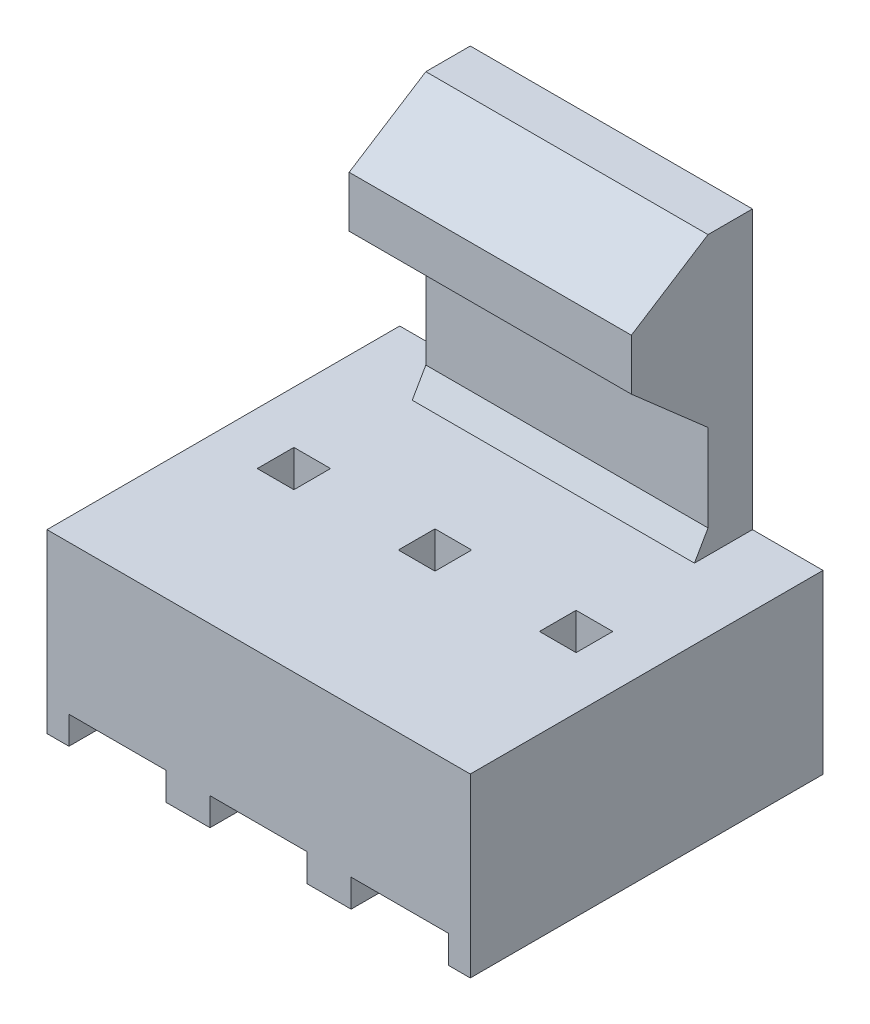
ISO-10303-21;
HEADER;
FILE_DESCRIPTION(('STEP AP214'),'2;1');
FILE_NAME('part.step','',(''),(''),'','','');
FILE_SCHEMA(('AUTOMOTIVE_DESIGN { 1 0 10303 214 1 1 1 1 }'));
ENDSEC;
DATA;
#1=APPLICATION_CONTEXT('core data for automotive mechanical design processes');
#2=APPLICATION_PROTOCOL_DEFINITION('international standard','automotive_design',2000,#1);
#3=PRODUCT_CONTEXT('',#1,'mechanical');
#4=PRODUCT('Part','Part','',(#3));
#5=PRODUCT_RELATED_PRODUCT_CATEGORY('part','',(#4));
#6=PRODUCT_DEFINITION_FORMATION('','',#4);
#7=PRODUCT_DEFINITION_CONTEXT('part definition',#1,'design');
#8=PRODUCT_DEFINITION('design','',#6,#7);
#9=PRODUCT_DEFINITION_SHAPE('','',#8);
#10=(LENGTH_UNIT() NAMED_UNIT(*) SI_UNIT(.MILLI.,.METRE.));
#11=(NAMED_UNIT(*) PLANE_ANGLE_UNIT() SI_UNIT($,.RADIAN.));
#12=(NAMED_UNIT(*) SI_UNIT($,.STERADIAN.) SOLID_ANGLE_UNIT());
#13=UNCERTAINTY_MEASURE_WITH_UNIT(LENGTH_MEASURE(1.E-05),#10,'distance_accuracy_value','');
#14=(GEOMETRIC_REPRESENTATION_CONTEXT(3) GLOBAL_UNCERTAINTY_ASSIGNED_CONTEXT((#13)) GLOBAL_UNIT_ASSIGNED_CONTEXT((#10,
#11,#12)) REPRESENTATION_CONTEXT('',''));
#15=CARTESIAN_POINT('',(0.,0.,0.));
#16=DIRECTION('',(0.,0.,1.));
#17=DIRECTION('',(1.,0.,0.));
#18=AXIS2_PLACEMENT_3D('',#15,#16,#17);
#19=CARTESIAN_POINT('',(-3.81,-3.18,-6.35));
#20=DIRECTION('',(0.,-1.,0.));
#21=DIRECTION('',(0.,0.,-1.));
#22=AXIS2_PLACEMENT_3D('',#19,#20,#21);
#23=PLANE('',#22);
#24=DIRECTION('',(0.,0.,1.));
#25=VECTOR('',#24,1.);
#26=CARTESIAN_POINT('',(1.665,-3.18,-6.351));
#27=LINE('',#26,#25);
#28=CARTESIAN_POINT('',(1.665,-3.18,-6.35));
#29=VERTEX_POINT('',#28);
#30=CARTESIAN_POINT('',(1.665,-3.18,0.));
#31=VERTEX_POINT('',#30);
#32=EDGE_CURVE('E443',#29,#31,#27,.T.);
#33=ORIENTED_EDGE('',*,*,#32,.T.);
#34=DIRECTION('',(1.,0.,0.));
#35=VECTOR('',#34,1.);
#36=CARTESIAN_POINT('',(-3.81,-3.18,0.));
#37=LINE('',#36,#35);
#38=CARTESIAN_POINT('',(0.875,-3.18,0.));
#39=VERTEX_POINT('',#38);
#40=EDGE_CURVE('E545',#39,#31,#37,.T.);
#41=ORIENTED_EDGE('',*,*,#40,.F.);
#42=DIRECTION('',(0.,0.,1.));
#43=VECTOR('',#42,1.);
#44=CARTESIAN_POINT('',(0.875,-3.18,-6.351));
#45=LINE('',#44,#43);
#46=CARTESIAN_POINT('',(0.875000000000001,-3.18,-6.35));
#47=VERTEX_POINT('',#46);
#48=EDGE_CURVE('E475',#47,#39,#45,.T.);
#49=ORIENTED_EDGE('',*,*,#48,.F.);
#50=DIRECTION('',(-1.,0.,0.));
#51=VECTOR('',#50,1.);
#52=CARTESIAN_POINT('',(-3.81,-3.18,-6.35));
#53=LINE('',#52,#51);
#54=EDGE_CURVE('E533',#29,#47,#53,.T.);
#55=ORIENTED_EDGE('',*,*,#54,.F.);
#56=EDGE_LOOP('',(#33,#41,#49,#55));
#57=FACE_BOUND('',#56,.T.);
#58=ADVANCED_FACE('F30',(#57),#23,.T.);
#59=DIRECTION('',(0.,0.,1.));
#60=VECTOR('',#59,1.);
#61=CARTESIAN_POINT('',(-0.874999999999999,-3.18,-6.351));
#62=LINE('',#61,#60);
#63=CARTESIAN_POINT('',(-0.874999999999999,-3.18,-6.35));
#64=VERTEX_POINT('',#63);
#65=CARTESIAN_POINT('',(-0.874999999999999,-3.18,0.));
#66=VERTEX_POINT('',#65);
#67=EDGE_CURVE('E469',#64,#66,#62,.T.);
#68=ORIENTED_EDGE('',*,*,#67,.T.);
#69=CARTESIAN_POINT('',(-1.665,-3.18,0.));
#70=VERTEX_POINT('',#69);
#71=EDGE_CURVE('E539',#70,#66,#37,.T.);
#72=ORIENTED_EDGE('',*,*,#71,.F.);
#73=DIRECTION('',(0.,0.,1.));
#74=VECTOR('',#73,1.);
#75=CARTESIAN_POINT('',(-1.665,-3.18,-6.351));
#76=LINE('',#75,#74);
#77=CARTESIAN_POINT('',(-1.665,-3.18,-6.35));
#78=VERTEX_POINT('',#77);
#79=EDGE_CURVE('E501',#78,#70,#76,.T.);
#80=ORIENTED_EDGE('',*,*,#79,.F.);
#81=EDGE_CURVE('E927',#64,#78,#53,.T.);
#82=ORIENTED_EDGE('',*,*,#81,.F.);
#83=EDGE_LOOP('',(#68,#72,#80,#82));
#84=FACE_BOUND('',#83,.T.);
#85=ADVANCED_FACE('F589',(#84),#23,.T.);
#86=DIRECTION('',(0.,0.,1.));
#87=VECTOR('',#86,1.);
#88=CARTESIAN_POINT('',(-3.415,-3.18,-6.351));
#89=LINE('',#88,#87);
#90=CARTESIAN_POINT('',(-3.415,-3.18,-6.35));
#91=VERTEX_POINT('',#90);
#92=CARTESIAN_POINT('',(-3.415,-3.18,0.));
#93=VERTEX_POINT('',#92);
#94=EDGE_CURVE('E495',#91,#93,#89,.T.);
#95=ORIENTED_EDGE('',*,*,#94,.T.);
#96=CARTESIAN_POINT('',(-3.81,-3.18,0.));
#97=VERTEX_POINT('',#96);
#98=EDGE_CURVE('E537',#97,#93,#37,.T.);
#99=ORIENTED_EDGE('',*,*,#98,.F.);
#100=DIRECTION('',(0.,0.,1.));
#101=VECTOR('',#100,1.);
#102=CARTESIAN_POINT('',(-3.81,-3.18,0.));
#103=LINE('',#102,#101);
#104=CARTESIAN_POINT('',(-3.81,-3.18,-6.35));
#105=VERTEX_POINT('',#104);
#106=EDGE_CURVE('E516',#105,#97,#103,.T.);
#107=ORIENTED_EDGE('',*,*,#106,.F.);
#108=EDGE_CURVE('E534',#91,#105,#53,.T.);
#109=ORIENTED_EDGE('',*,*,#108,.F.);
#110=EDGE_LOOP('',(#95,#99,#107,#109));
#111=FACE_BOUND('',#110,.T.);
#112=ADVANCED_FACE('F558',(#111),#23,.T.);
#113=CARTESIAN_POINT('',(-3.81,-3.18,0.));
#114=DIRECTION('',(-1.,0.,0.));
#115=DIRECTION('',(0.,0.,1.));
#116=AXIS2_PLACEMENT_3D('',#113,#114,#115);
#117=PLANE('',#116);
#118=DIRECTION('',(0.,0.,1.));
#119=VECTOR('',#118,1.);
#120=CARTESIAN_POINT('',(-3.81,0.,0.));
#121=LINE('',#120,#119);
#122=CARTESIAN_POINT('',(-3.81,0.,-6.35));
#123=VERTEX_POINT('',#122);
#124=CARTESIAN_POINT('',(-3.81,0.,0.));
#125=VERTEX_POINT('',#124);
#126=EDGE_CURVE('E498',#123,#125,#121,.T.);
#127=ORIENTED_EDGE('',*,*,#126,.F.);
#128=DIRECTION('',(0.,1.,0.));
#129=VECTOR('',#128,1.);
#130=CARTESIAN_POINT('',(-3.81,-3.18,-6.35));
#131=LINE('',#130,#129);
#132=EDGE_CURVE('E11',#105,#123,#131,.T.);
#133=ORIENTED_EDGE('',*,*,#132,.F.);
#134=ORIENTED_EDGE('',*,*,#106,.T.);
#135=DIRECTION('',(0.,1.,0.));
#136=VECTOR('',#135,1.);
#137=CARTESIAN_POINT('',(-3.81,-3.18,0.));
#138=LINE('',#137,#136);
#139=EDGE_CURVE('E525',#97,#125,#138,.T.);
#140=ORIENTED_EDGE('',*,*,#139,.T.);
#141=EDGE_LOOP('',(#127,#133,#134,#140));
#142=FACE_BOUND('',#141,.T.);
#143=ADVANCED_FACE('F32',(#142),#117,.T.);
#144=CARTESIAN_POINT('',(-3.81,-3.18,-6.35));
#145=DIRECTION('',(0.,0.,-1.));
#146=DIRECTION('',(-1.,0.,0.));
#147=AXIS2_PLACEMENT_3D('',#144,#145,#146);
#148=PLANE('',#147);
#149=DIRECTION('',(0.,-1.,0.));
#150=VECTOR('',#149,1.);
#151=CARTESIAN_POINT('',(1.665,-3.18,-6.35));
#152=LINE('',#151,#150);
#153=CARTESIAN_POINT('',(1.665,-2.68,-6.35));
#154=VERTEX_POINT('',#153);
#155=EDGE_CURVE('E432',#154,#29,#152,.T.);
#156=ORIENTED_EDGE('',*,*,#155,.T.);
#157=ORIENTED_EDGE('',*,*,#54,.T.);
#158=DIRECTION('',(0.,1.,0.));
#159=VECTOR('',#158,1.);
#160=CARTESIAN_POINT('',(0.875,-3.18,-6.35));
#161=LINE('',#160,#159);
#162=CARTESIAN_POINT('',(0.875000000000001,-2.68,-6.35));
#163=VERTEX_POINT('',#162);
#164=EDGE_CURVE('E446',#47,#163,#161,.T.);
#165=ORIENTED_EDGE('',*,*,#164,.T.);
#166=DIRECTION('',(-1.,0.,0.));
#167=VECTOR('',#166,1.);
#168=CARTESIAN_POINT('',(-0.874999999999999,-2.68,-6.35));
#169=LINE('',#168,#167);
#170=CARTESIAN_POINT('',(-0.874999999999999,-2.68,-6.35));
#171=VERTEX_POINT('',#170);
#172=EDGE_CURVE('E455',#163,#171,#169,.T.);
#173=ORIENTED_EDGE('',*,*,#172,.T.);
#174=DIRECTION('',(0.,-1.,0.));
#175=VECTOR('',#174,1.);
#176=CARTESIAN_POINT('',(-0.874999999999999,-3.18,-6.35));
#177=LINE('',#176,#175);
#178=EDGE_CURVE('E458',#171,#64,#177,.T.);
#179=ORIENTED_EDGE('',*,*,#178,.T.);
#180=ORIENTED_EDGE('',*,*,#81,.T.);
#181=DIRECTION('',(0.,1.,0.));
#182=VECTOR('',#181,1.);
#183=CARTESIAN_POINT('',(-1.665,-3.18,-6.35));
#184=LINE('',#183,#182);
#185=CARTESIAN_POINT('',(-1.665,-2.68,-6.35));
#186=VERTEX_POINT('',#185);
#187=EDGE_CURVE('E472',#78,#186,#184,.T.);
#188=ORIENTED_EDGE('',*,*,#187,.T.);
#189=DIRECTION('',(-1.,0.,0.));
#190=VECTOR('',#189,1.);
#191=CARTESIAN_POINT('',(-3.415,-2.68,-6.35));
#192=LINE('',#191,#190);
#193=CARTESIAN_POINT('',(-3.415,-2.68,-6.35));
#194=VERTEX_POINT('',#193);
#195=EDGE_CURVE('E481',#186,#194,#192,.T.);
#196=ORIENTED_EDGE('',*,*,#195,.T.);
#197=DIRECTION('',(0.,-1.,0.));
#198=VECTOR('',#197,1.);
#199=CARTESIAN_POINT('',(-3.415,-3.18,-6.35));
#200=LINE('',#199,#198);
#201=EDGE_CURVE('E484',#194,#91,#200,.T.);
#202=ORIENTED_EDGE('',*,*,#201,.T.);
#203=ORIENTED_EDGE('',*,*,#108,.T.);
#204=ORIENTED_EDGE('',*,*,#132,.T.);
#205=DIRECTION('',(-1.,0.,0.));
#206=VECTOR('',#205,1.);
#207=CARTESIAN_POINT('',(-3.81,0.,-6.35));
#208=LINE('',#207,#206);
#209=CARTESIAN_POINT('',(-2.54,0.,-6.35));
#210=VERTEX_POINT('',#209);
#211=EDGE_CURVE('E513',#210,#123,#208,.T.);
#212=ORIENTED_EDGE('',*,*,#211,.F.);
#213=DIRECTION('',(0.,1.,0.));
#214=VECTOR('',#213,1.);
#215=CARTESIAN_POINT('',(-2.54,0.,-6.35));
#216=LINE('',#215,#214);
#217=CARTESIAN_POINT('',(-2.54,5.,-6.35));
#218=VERTEX_POINT('',#217);
#219=EDGE_CURVE('E305',#210,#218,#216,.T.);
#220=ORIENTED_EDGE('',*,*,#219,.T.);
#221=DIRECTION('',(-1.,0.,0.));
#222=VECTOR('',#221,1.);
#223=CARTESIAN_POINT('',(2.54,5.,-6.35));
#224=LINE('',#223,#222);
#225=CARTESIAN_POINT('',(2.54,5.,-6.35));
#226=VERTEX_POINT('',#225);
#227=EDGE_CURVE('E289',#226,#218,#224,.T.);
#228=ORIENTED_EDGE('',*,*,#227,.F.);
#229=DIRECTION('',(0.,1.,0.));
#230=VECTOR('',#229,1.);
#231=CARTESIAN_POINT('',(2.54,0.,-6.35));
#232=LINE('',#231,#230);
#233=CARTESIAN_POINT('',(2.54,0.,-6.35));
#234=VERTEX_POINT('',#233);
#235=EDGE_CURVE('E323',#234,#226,#232,.T.);
#236=ORIENTED_EDGE('',*,*,#235,.F.);
#237=CARTESIAN_POINT('',(3.81,0.,-6.35));
#238=VERTEX_POINT('',#237);
#239=EDGE_CURVE('E522',#238,#234,#208,.T.);
#240=ORIENTED_EDGE('',*,*,#239,.F.);
#241=DIRECTION('',(0.,1.,0.));
#242=VECTOR('',#241,1.);
#243=CARTESIAN_POINT('',(3.81,-3.18,-6.35));
#244=LINE('',#243,#242);
#245=CARTESIAN_POINT('',(3.81,-3.18,-6.35));
#246=VERTEX_POINT('',#245);
#247=EDGE_CURVE('E39',#246,#238,#244,.T.);
#248=ORIENTED_EDGE('',*,*,#247,.F.);
#249=CARTESIAN_POINT('',(3.415,-3.18,-6.35));
#250=VERTEX_POINT('',#249);
#251=EDGE_CURVE('E528',#246,#250,#53,.T.);
#252=ORIENTED_EDGE('',*,*,#251,.T.);
#253=DIRECTION('',(0.,1.,0.));
#254=VECTOR('',#253,1.);
#255=CARTESIAN_POINT('',(3.415,-3.18,-6.35));
#256=LINE('',#255,#254);
#257=CARTESIAN_POINT('',(3.415,-2.68,-6.35));
#258=VERTEX_POINT('',#257);
#259=EDGE_CURVE('E426',#250,#258,#256,.T.);
#260=ORIENTED_EDGE('',*,*,#259,.T.);
#261=DIRECTION('',(-1.,0.,0.));
#262=VECTOR('',#261,1.);
#263=CARTESIAN_POINT('',(1.665,-2.68,-6.35));
#264=LINE('',#263,#262);
#265=EDGE_CURVE('E429',#258,#154,#264,.T.);
#266=ORIENTED_EDGE('',*,*,#265,.T.);
#267=EDGE_LOOP('',(#156,#157,#165,#173,#179,#180,#188,#196,#202,#203,#204,#212,#220,#228,#236,
#240,#248,#252,#260,#266));
#268=FACE_BOUND('',#267,.T.);
#269=ADVANCED_FACE('F562',(#268),#148,.T.);
#270=CARTESIAN_POINT('',(3.81,-3.18,0.));
#271=DIRECTION('',(1.,0.,0.));
#272=DIRECTION('',(0.,0.,-1.));
#273=AXIS2_PLACEMENT_3D('',#270,#271,#272);
#274=PLANE('',#273);
#275=DIRECTION('',(0.,0.,-1.));
#276=VECTOR('',#275,1.);
#277=CARTESIAN_POINT('',(3.81,0.,0.));
#278=LINE('',#277,#276);
#279=CARTESIAN_POINT('',(3.81,0.,0.));
#280=VERTEX_POINT('',#279);
#281=EDGE_CURVE('E510',#280,#238,#278,.T.);
#282=ORIENTED_EDGE('',*,*,#281,.F.);
#283=DIRECTION('',(0.,1.,0.));
#284=VECTOR('',#283,1.);
#285=CARTESIAN_POINT('',(3.81,-3.18,0.));
#286=LINE('',#285,#284);
#287=CARTESIAN_POINT('',(3.81,-3.18,0.));
#288=VERTEX_POINT('',#287);
#289=EDGE_CURVE('E527',#288,#280,#286,.T.);
#290=ORIENTED_EDGE('',*,*,#289,.F.);
#291=DIRECTION('',(0.,0.,-1.));
#292=VECTOR('',#291,1.);
#293=CARTESIAN_POINT('',(3.81,-3.18,0.));
#294=LINE('',#293,#292);
#295=EDGE_CURVE('E535',#288,#246,#294,.T.);
#296=ORIENTED_EDGE('',*,*,#295,.T.);
#297=ORIENTED_EDGE('',*,*,#247,.T.);
#298=EDGE_LOOP('',(#282,#290,#296,#297));
#299=FACE_BOUND('',#298,.T.);
#300=ADVANCED_FACE('F578',(#299),#274,.T.);
#301=CARTESIAN_POINT('',(-3.81,-3.18,0.));
#302=DIRECTION('',(0.,0.,1.));
#303=DIRECTION('',(1.,0.,0.));
#304=AXIS2_PLACEMENT_3D('',#301,#302,#303);
#305=PLANE('',#304);
#306=DIRECTION('',(0.,-1.,0.));
#307=VECTOR('',#306,1.);
#308=CARTESIAN_POINT('',(1.665,-3.18,0.));
#309=LINE('',#308,#307);
#310=CARTESIAN_POINT('',(1.665,-2.68,0.));
#311=VERTEX_POINT('',#310);
#312=EDGE_CURVE('E435',#311,#31,#309,.T.);
#313=ORIENTED_EDGE('',*,*,#312,.F.);
#314=DIRECTION('',(-1.,0.,0.));
#315=VECTOR('',#314,1.);
#316=CARTESIAN_POINT('',(1.665,-2.68,0.));
#317=LINE('',#316,#315);
#318=CARTESIAN_POINT('',(3.415,-2.68,0.));
#319=VERTEX_POINT('',#318);
#320=EDGE_CURVE('E440',#319,#311,#317,.T.);
#321=ORIENTED_EDGE('',*,*,#320,.F.);
#322=DIRECTION('',(0.,1.,0.));
#323=VECTOR('',#322,1.);
#324=CARTESIAN_POINT('',(3.415,-3.18,0.));
#325=LINE('',#324,#323);
#326=CARTESIAN_POINT('',(3.415,-3.18,0.));
#327=VERTEX_POINT('',#326);
#328=EDGE_CURVE('E437',#327,#319,#325,.T.);
#329=ORIENTED_EDGE('',*,*,#328,.F.);
#330=EDGE_CURVE('E540',#327,#288,#37,.T.);
#331=ORIENTED_EDGE('',*,*,#330,.T.);
#332=ORIENTED_EDGE('',*,*,#289,.T.);
#333=DIRECTION('',(1.,0.,0.));
#334=VECTOR('',#333,1.);
#335=CARTESIAN_POINT('',(-3.81,0.,0.));
#336=LINE('',#335,#334);
#337=EDGE_CURVE('E507',#125,#280,#336,.T.);
#338=ORIENTED_EDGE('',*,*,#337,.F.);
#339=ORIENTED_EDGE('',*,*,#139,.F.);
#340=ORIENTED_EDGE('',*,*,#98,.T.);
#341=DIRECTION('',(0.,-1.,0.));
#342=VECTOR('',#341,1.);
#343=CARTESIAN_POINT('',(-3.415,-3.18,0.));
#344=LINE('',#343,#342);
#345=CARTESIAN_POINT('',(-3.415,-2.68,0.));
#346=VERTEX_POINT('',#345);
#347=EDGE_CURVE('E487',#346,#93,#344,.T.);
#348=ORIENTED_EDGE('',*,*,#347,.F.);
#349=DIRECTION('',(-1.,0.,0.));
#350=VECTOR('',#349,1.);
#351=CARTESIAN_POINT('',(-3.415,-2.68,0.));
#352=LINE('',#351,#350);
#353=CARTESIAN_POINT('',(-1.665,-2.68,0.));
#354=VERTEX_POINT('',#353);
#355=EDGE_CURVE('E492',#354,#346,#352,.T.);
#356=ORIENTED_EDGE('',*,*,#355,.F.);
#357=DIRECTION('',(0.,1.,0.));
#358=VECTOR('',#357,1.);
#359=CARTESIAN_POINT('',(-1.665,-3.18,0.));
#360=LINE('',#359,#358);
#361=EDGE_CURVE('E489',#70,#354,#360,.T.);
#362=ORIENTED_EDGE('',*,*,#361,.F.);
#363=ORIENTED_EDGE('',*,*,#71,.T.);
#364=DIRECTION('',(0.,-1.,0.));
#365=VECTOR('',#364,1.);
#366=CARTESIAN_POINT('',(-0.874999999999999,-3.18,0.));
#367=LINE('',#366,#365);
#368=CARTESIAN_POINT('',(-0.874999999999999,-2.68,0.));
#369=VERTEX_POINT('',#368);
#370=EDGE_CURVE('E461',#369,#66,#367,.T.);
#371=ORIENTED_EDGE('',*,*,#370,.F.);
#372=DIRECTION('',(-1.,0.,0.));
#373=VECTOR('',#372,1.);
#374=CARTESIAN_POINT('',(-0.874999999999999,-2.68,0.));
#375=LINE('',#374,#373);
#376=CARTESIAN_POINT('',(0.875000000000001,-2.68,0.));
#377=VERTEX_POINT('',#376);
#378=EDGE_CURVE('E466',#377,#369,#375,.T.);
#379=ORIENTED_EDGE('',*,*,#378,.F.);
#380=DIRECTION('',(0.,1.,0.));
#381=VECTOR('',#380,1.);
#382=CARTESIAN_POINT('',(0.875,-3.18,0.));
#383=LINE('',#382,#381);
#384=EDGE_CURVE('E463',#39,#377,#383,.T.);
#385=ORIENTED_EDGE('',*,*,#384,.F.);
#386=ORIENTED_EDGE('',*,*,#40,.T.);
#387=EDGE_LOOP('',(#313,#321,#329,#331,#332,#338,#339,#340,#348,#356,#362,#363,#371,#379,#385,#386));
#388=FACE_BOUND('',#387,.T.);
#389=ADVANCED_FACE('F574',(#388),#305,.T.);
#390=DIRECTION('',(0.,0.,1.));
#391=VECTOR('',#390,1.);
#392=CARTESIAN_POINT('',(3.415,-3.18,-6.351));
#393=LINE('',#392,#391);
#394=EDGE_CURVE('E449',#250,#327,#393,.T.);
#395=ORIENTED_EDGE('',*,*,#394,.F.);
#396=ORIENTED_EDGE('',*,*,#251,.F.);
#397=ORIENTED_EDGE('',*,*,#295,.F.);
#398=ORIENTED_EDGE('',*,*,#330,.F.);
#399=EDGE_LOOP('',(#395,#396,#397,#398));
#400=FACE_BOUND('',#399,.T.);
#401=ADVANCED_FACE('F577',(#400),#23,.T.);
#402=CARTESIAN_POINT('',(-3.81,0.,-6.35));
#403=DIRECTION('',(0.,-1.,0.));
#404=DIRECTION('',(0.,0.,-1.));
#405=AXIS2_PLACEMENT_3D('',#402,#403,#404);
#406=PLANE('',#405);
#407=DIRECTION('',(-1.,0.,0.));
#408=VECTOR('',#407,1.);
#409=CARTESIAN_POINT('',(2.54,0.,-5.30538590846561));
#410=LINE('',#409,#408);
#411=CARTESIAN_POINT('',(2.54,0.,-5.30538590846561));
#412=VERTEX_POINT('',#411);
#413=CARTESIAN_POINT('',(-2.54,0.,-5.30538590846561));
#414=VERTEX_POINT('',#413);
#415=EDGE_CURVE('E322',#412,#414,#410,.T.);
#416=ORIENTED_EDGE('',*,*,#415,.T.);
#417=DIRECTION('',(0.,0.,-1.));
#418=VECTOR('',#417,1.);
#419=CARTESIAN_POINT('',(-2.54,0.,-5.30538590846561));
#420=LINE('',#419,#418);
#421=EDGE_CURVE('E47',#414,#210,#420,.T.);
#422=ORIENTED_EDGE('',*,*,#421,.T.);
#423=ORIENTED_EDGE('',*,*,#211,.T.);
#424=ORIENTED_EDGE('',*,*,#126,.T.);
#425=ORIENTED_EDGE('',*,*,#337,.T.);
#426=ORIENTED_EDGE('',*,*,#281,.T.);
#427=ORIENTED_EDGE('',*,*,#239,.T.);
#428=DIRECTION('',(0.,0.,-1.));
#429=VECTOR('',#428,1.);
#430=CARTESIAN_POINT('',(2.54,0.,-5.30538590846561));
#431=LINE('',#430,#429);
#432=EDGE_CURVE('E320',#412,#234,#431,.T.);
#433=ORIENTED_EDGE('',*,*,#432,.F.);
#434=EDGE_LOOP('',(#416,#422,#423,#424,#425,#426,#427,#433));
#435=FACE_BOUND('',#434,.T.);
#436=DIRECTION('',(0.,0.,1.));
#437=VECTOR('',#436,1.);
#438=CARTESIAN_POINT('',(2.21,0.,-3.50500000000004));
#439=LINE('',#438,#437);
#440=CARTESIAN_POINT('',(2.21,0.,-3.50500000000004));
#441=VERTEX_POINT('',#440);
#442=CARTESIAN_POINT('',(2.21,0.,-2.84500000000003));
#443=VERTEX_POINT('',#442);
#444=EDGE_CURVE('E344',#441,#443,#439,.T.);
#445=ORIENTED_EDGE('',*,*,#444,.F.);
#446=DIRECTION('',(-1.,0.,0.));
#447=VECTOR('',#446,1.);
#448=CARTESIAN_POINT('',(2.21,0.,-3.50500000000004));
#449=LINE('',#448,#447);
#450=CARTESIAN_POINT('',(2.87,0.,-3.50500000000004));
#451=VERTEX_POINT('',#450);
#452=EDGE_CURVE('E55',#451,#441,#449,.T.);
#453=ORIENTED_EDGE('',*,*,#452,.F.);
#454=DIRECTION('',(0.,0.,-1.));
#455=VECTOR('',#454,1.);
#456=CARTESIAN_POINT('',(2.87,0.,-3.50500000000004));
#457=LINE('',#456,#455);
#458=CARTESIAN_POINT('',(2.87,0.,-2.84500000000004));
#459=VERTEX_POINT('',#458);
#460=EDGE_CURVE('E350',#459,#451,#457,.T.);
#461=ORIENTED_EDGE('',*,*,#460,.F.);
#462=DIRECTION('',(1.,0.,0.));
#463=VECTOR('',#462,1.);
#464=CARTESIAN_POINT('',(2.21,0.,-2.84500000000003));
#465=LINE('',#464,#463);
#466=EDGE_CURVE('E347',#443,#459,#465,.T.);
#467=ORIENTED_EDGE('',*,*,#466,.F.);
#468=EDGE_LOOP('',(#445,#453,#461,#467));
#469=FACE_BOUND('',#468,.T.);
#470=DIRECTION('',(0.,0.,1.));
#471=VECTOR('',#470,1.);
#472=CARTESIAN_POINT('',(-0.33,0.,-3.50500000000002));
#473=LINE('',#472,#471);
#474=CARTESIAN_POINT('',(-0.33,0.,-3.50500000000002));
#475=VERTEX_POINT('',#474);
#476=CARTESIAN_POINT('',(-0.33,0.,-2.84500000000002));
#477=VERTEX_POINT('',#476);
#478=EDGE_CURVE('E374',#475,#477,#473,.T.);
#479=ORIENTED_EDGE('',*,*,#478,.F.);
#480=DIRECTION('',(-1.,0.,0.));
#481=VECTOR('',#480,1.);
#482=CARTESIAN_POINT('',(-0.33,0.,-3.50500000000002));
#483=LINE('',#482,#481);
#484=CARTESIAN_POINT('',(0.33,0.,-3.50500000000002));
#485=VERTEX_POINT('',#484);
#486=EDGE_CURVE('E372',#485,#475,#483,.T.);
#487=ORIENTED_EDGE('',*,*,#486,.F.);
#488=DIRECTION('',(0.,0.,-1.));
#489=VECTOR('',#488,1.);
#490=CARTESIAN_POINT('',(0.33,0.,-3.50500000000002));
#491=LINE('',#490,#489);
#492=CARTESIAN_POINT('',(0.33,0.,-2.84500000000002));
#493=VERTEX_POINT('',#492);
#494=EDGE_CURVE('E380',#493,#485,#491,.T.);
#495=ORIENTED_EDGE('',*,*,#494,.F.);
#496=DIRECTION('',(1.,0.,0.));
#497=VECTOR('',#496,1.);
#498=CARTESIAN_POINT('',(-0.33,0.,-2.84500000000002));
#499=LINE('',#498,#497);
#500=EDGE_CURVE('E377',#477,#493,#499,.T.);
#501=ORIENTED_EDGE('',*,*,#500,.F.);
#502=EDGE_LOOP('',(#479,#487,#495,#501));
#503=FACE_BOUND('',#502,.T.);
#504=DIRECTION('',(1.,0.,0.));
#505=VECTOR('',#504,1.);
#506=CARTESIAN_POINT('',(-2.87,0.,-2.845));
#507=LINE('',#506,#505);
#508=CARTESIAN_POINT('',(-2.87,0.,-2.845));
#509=VERTEX_POINT('',#508);
#510=CARTESIAN_POINT('',(-2.21,0.,-2.845));
#511=VERTEX_POINT('',#510);
#512=EDGE_CURVE('E405',#509,#511,#507,.T.);
#513=ORIENTED_EDGE('',*,*,#512,.F.);
#514=DIRECTION('',(0.,0.,1.));
#515=VECTOR('',#514,1.);
#516=CARTESIAN_POINT('',(-2.87,0.,-3.505));
#517=LINE('',#516,#515);
#518=CARTESIAN_POINT('',(-2.87,0.,-3.505));
#519=VERTEX_POINT('',#518);
#520=EDGE_CURVE('E403',#519,#509,#517,.T.);
#521=ORIENTED_EDGE('',*,*,#520,.F.);
#522=DIRECTION('',(-1.,0.,0.));
#523=VECTOR('',#522,1.);
#524=CARTESIAN_POINT('',(-2.87,0.,-3.505));
#525=LINE('',#524,#523);
#526=CARTESIAN_POINT('',(-2.21,0.,-3.505));
#527=VERTEX_POINT('',#526);
#528=EDGE_CURVE('E411',#527,#519,#525,.T.);
#529=ORIENTED_EDGE('',*,*,#528,.F.);
#530=DIRECTION('',(0.,0.,-1.));
#531=VECTOR('',#530,1.);
#532=CARTESIAN_POINT('',(-2.21,0.,-3.505));
#533=LINE('',#532,#531);
#534=EDGE_CURVE('E408',#511,#527,#533,.T.);
#535=ORIENTED_EDGE('',*,*,#534,.F.);
#536=EDGE_LOOP('',(#513,#521,#529,#535));
#537=FACE_BOUND('',#536,.T.);
#538=ADVANCED_FACE('F583',(#435,#469,#503,#537),#406,.F.);
#539=CARTESIAN_POINT('',(-3.415,-3.18,-6.351));
#540=DIRECTION('',(-1.,0.,0.));
#541=DIRECTION('',(0.,0.,1.));
#542=AXIS2_PLACEMENT_3D('',#539,#540,#541);
#543=PLANE('',#542);
#544=DIRECTION('',(0.,0.,1.));
#545=VECTOR('',#544,1.);
#546=CARTESIAN_POINT('',(-3.415,-2.68,-6.351));
#547=LINE('',#546,#545);
#548=EDGE_CURVE('E496',#194,#346,#547,.T.);
#549=ORIENTED_EDGE('',*,*,#548,.T.);
#550=ORIENTED_EDGE('',*,*,#347,.T.);
#551=ORIENTED_EDGE('',*,*,#94,.F.);
#552=ORIENTED_EDGE('',*,*,#201,.F.);
#553=EDGE_LOOP('',(#549,#550,#551,#552));
#554=FACE_BOUND('',#553,.T.);
#555=ADVANCED_FACE('F560',(#554),#543,.F.);
#556=CARTESIAN_POINT('',(-3.415,-2.68,-6.351));
#557=DIRECTION('',(0.,1.,0.));
#558=DIRECTION('',(0.,0.,1.));
#559=AXIS2_PLACEMENT_3D('',#556,#557,#558);
#560=PLANE('',#559);
#561=DIRECTION('',(1.,0.,0.));
#562=VECTOR('',#561,1.);
#563=CARTESIAN_POINT('',(-2.87,-2.68,-3.505));
#564=LINE('',#563,#562);
#565=CARTESIAN_POINT('',(-2.87,-2.68,-3.505));
#566=VERTEX_POINT('',#565);
#567=CARTESIAN_POINT('',(-2.21,-2.68,-3.505));
#568=VERTEX_POINT('',#567);
#569=EDGE_CURVE('E397',#566,#568,#564,.T.);
#570=ORIENTED_EDGE('',*,*,#569,.F.);
#571=DIRECTION('',(0.,0.,-1.));
#572=VECTOR('',#571,1.);
#573=CARTESIAN_POINT('',(-2.87,-2.68,-3.505));
#574=LINE('',#573,#572);
#575=CARTESIAN_POINT('',(-2.87,-2.68,-2.845));
#576=VERTEX_POINT('',#575);
#577=EDGE_CURVE('E400',#576,#566,#574,.T.);
#578=ORIENTED_EDGE('',*,*,#577,.F.);
#579=DIRECTION('',(-1.,0.,0.));
#580=VECTOR('',#579,1.);
#581=CARTESIAN_POINT('',(-2.87,-2.68,-2.845));
#582=LINE('',#581,#580);
#583=CARTESIAN_POINT('',(-2.21,-2.68,-2.845));
#584=VERTEX_POINT('',#583);
#585=EDGE_CURVE('E417',#584,#576,#582,.T.);
#586=ORIENTED_EDGE('',*,*,#585,.F.);
#587=DIRECTION('',(0.,0.,1.));
#588=VECTOR('',#587,1.);
#589=CARTESIAN_POINT('',(-2.21,-2.68,-3.505));
#590=LINE('',#589,#588);
#591=EDGE_CURVE('E395',#568,#584,#590,.T.);
#592=ORIENTED_EDGE('',*,*,#591,.F.);
#593=EDGE_LOOP('',(#570,#578,#586,#592));
#594=FACE_BOUND('',#593,.T.);
#595=DIRECTION('',(0.,0.,1.));
#596=VECTOR('',#595,1.);
#597=CARTESIAN_POINT('',(-1.665,-2.68,-6.351));
#598=LINE('',#597,#596);
#599=EDGE_CURVE('E499',#186,#354,#598,.T.);
#600=ORIENTED_EDGE('',*,*,#599,.T.);
#601=ORIENTED_EDGE('',*,*,#355,.T.);
#602=ORIENTED_EDGE('',*,*,#548,.F.);
#603=ORIENTED_EDGE('',*,*,#195,.F.);
#604=EDGE_LOOP('',(#600,#601,#602,#603));
#605=FACE_BOUND('',#604,.T.);
#606=ADVANCED_FACE('F566',(#594,#605),#560,.F.);
#607=CARTESIAN_POINT('',(-1.665,-3.18,-6.351));
#608=DIRECTION('',(1.,0.,0.));
#609=DIRECTION('',(0.,1.,0.));
#610=AXIS2_PLACEMENT_3D('',#607,#608,#609);
#611=PLANE('',#610);
#612=ORIENTED_EDGE('',*,*,#79,.T.);
#613=ORIENTED_EDGE('',*,*,#361,.T.);
#614=ORIENTED_EDGE('',*,*,#599,.F.);
#615=ORIENTED_EDGE('',*,*,#187,.F.);
#616=EDGE_LOOP('',(#612,#613,#614,#615));
#617=FACE_BOUND('',#616,.T.);
#618=ADVANCED_FACE('F568',(#617),#611,.F.);
#619=CARTESIAN_POINT('',(-0.874999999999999,-3.18,-6.351));
#620=DIRECTION('',(-1.,0.,0.));
#621=DIRECTION('',(0.,0.,1.));
#622=AXIS2_PLACEMENT_3D('',#619,#620,#621);
#623=PLANE('',#622);
#624=DIRECTION('',(0.,0.,1.));
#625=VECTOR('',#624,1.);
#626=CARTESIAN_POINT('',(-0.874999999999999,-2.68,-6.351));
#627=LINE('',#626,#625);
#628=EDGE_CURVE('E470',#171,#369,#627,.T.);
#629=ORIENTED_EDGE('',*,*,#628,.T.);
#630=ORIENTED_EDGE('',*,*,#370,.T.);
#631=ORIENTED_EDGE('',*,*,#67,.F.);
#632=ORIENTED_EDGE('',*,*,#178,.F.);
#633=EDGE_LOOP('',(#629,#630,#631,#632));
#634=FACE_BOUND('',#633,.T.);
#635=ADVANCED_FACE('F848',(#634),#623,.F.);
#636=CARTESIAN_POINT('',(-0.874999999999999,-2.68,-6.351));
#637=DIRECTION('',(0.,1.,0.));
#638=DIRECTION('',(0.,0.,1.));
#639=AXIS2_PLACEMENT_3D('',#636,#637,#638);
#640=PLANE('',#639);
#641=DIRECTION('',(0.,0.,1.));
#642=VECTOR('',#641,1.);
#643=CARTESIAN_POINT('',(0.33,-2.68,-3.50500000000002));
#644=LINE('',#643,#642);
#645=CARTESIAN_POINT('',(0.33,-2.68,-3.50500000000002));
#646=VERTEX_POINT('',#645);
#647=CARTESIAN_POINT('',(0.33,-2.68,-2.84500000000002));
#648=VERTEX_POINT('',#647);
#649=EDGE_CURVE('E366',#646,#648,#644,.T.);
#650=ORIENTED_EDGE('',*,*,#649,.F.);
#651=DIRECTION('',(1.,0.,0.));
#652=VECTOR('',#651,1.);
#653=CARTESIAN_POINT('',(-0.33,-2.68,-3.50500000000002));
#654=LINE('',#653,#652);
#655=CARTESIAN_POINT('',(-0.33,-2.68,-3.50500000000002));
#656=VERTEX_POINT('',#655);
#657=EDGE_CURVE('E369',#656,#646,#654,.T.);
#658=ORIENTED_EDGE('',*,*,#657,.F.);
#659=DIRECTION('',(0.,0.,-1.));
#660=VECTOR('',#659,1.);
#661=CARTESIAN_POINT('',(-0.33,-2.68,-3.50500000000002));
#662=LINE('',#661,#660);
#663=CARTESIAN_POINT('',(-0.33,-2.68,-2.84500000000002));
#664=VERTEX_POINT('',#663);
#665=EDGE_CURVE('E386',#664,#656,#662,.T.);
#666=ORIENTED_EDGE('',*,*,#665,.F.);
#667=DIRECTION('',(-1.,0.,0.));
#668=VECTOR('',#667,1.);
#669=CARTESIAN_POINT('',(-0.33,-2.68,-2.84500000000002));
#670=LINE('',#669,#668);
#671=EDGE_CURVE('E364',#648,#664,#670,.T.);
#672=ORIENTED_EDGE('',*,*,#671,.F.);
#673=EDGE_LOOP('',(#650,#658,#666,#672));
#674=FACE_BOUND('',#673,.T.);
#675=DIRECTION('',(0.,0.,1.));
#676=VECTOR('',#675,1.);
#677=CARTESIAN_POINT('',(0.875000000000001,-2.68,-6.351));
#678=LINE('',#677,#676);
#679=EDGE_CURVE('E473',#163,#377,#678,.T.);
#680=ORIENTED_EDGE('',*,*,#679,.T.);
#681=ORIENTED_EDGE('',*,*,#378,.T.);
#682=ORIENTED_EDGE('',*,*,#628,.F.);
#683=ORIENTED_EDGE('',*,*,#172,.F.);
#684=EDGE_LOOP('',(#680,#681,#682,#683));
#685=FACE_BOUND('',#684,.T.);
#686=ADVANCED_FACE('F840',(#674,#685),#640,.F.);
#687=CARTESIAN_POINT('',(0.875,-3.18,-6.351));
#688=DIRECTION('',(1.,0.,0.));
#689=DIRECTION('',(0.,1.,0.));
#690=AXIS2_PLACEMENT_3D('',#687,#688,#689);
#691=PLANE('',#690);
#692=ORIENTED_EDGE('',*,*,#48,.T.);
#693=ORIENTED_EDGE('',*,*,#384,.T.);
#694=ORIENTED_EDGE('',*,*,#679,.F.);
#695=ORIENTED_EDGE('',*,*,#164,.F.);
#696=EDGE_LOOP('',(#692,#693,#694,#695));
#697=FACE_BOUND('',#696,.T.);
#698=ADVANCED_FACE('F832',(#697),#691,.F.);
#699=CARTESIAN_POINT('',(1.665,-3.18,-6.351));
#700=DIRECTION('',(-1.,0.,0.));
#701=DIRECTION('',(0.,0.,1.));
#702=AXIS2_PLACEMENT_3D('',#699,#700,#701);
#703=PLANE('',#702);
#704=DIRECTION('',(0.,0.,1.));
#705=VECTOR('',#704,1.);
#706=CARTESIAN_POINT('',(1.665,-2.68,-6.351));
#707=LINE('',#706,#705);
#708=EDGE_CURVE('E444',#154,#311,#707,.T.);
#709=ORIENTED_EDGE('',*,*,#708,.T.);
#710=ORIENTED_EDGE('',*,*,#312,.T.);
#711=ORIENTED_EDGE('',*,*,#32,.F.);
#712=ORIENTED_EDGE('',*,*,#155,.F.);
#713=EDGE_LOOP('',(#709,#710,#711,#712));
#714=FACE_BOUND('',#713,.T.);
#715=ADVANCED_FACE('F824',(#714),#703,.F.);
#716=CARTESIAN_POINT('',(1.665,-2.68,-6.351));
#717=DIRECTION('',(0.,1.,0.));
#718=DIRECTION('',(0.,0.,1.));
#719=AXIS2_PLACEMENT_3D('',#716,#717,#718);
#720=PLANE('',#719);
#721=DIRECTION('',(0.,0.,1.));
#722=VECTOR('',#721,1.);
#723=CARTESIAN_POINT('',(2.87,-2.68,-3.50500000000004));
#724=LINE('',#723,#722);
#725=CARTESIAN_POINT('',(2.87,-2.68,-3.50500000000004));
#726=VERTEX_POINT('',#725);
#727=CARTESIAN_POINT('',(2.87,-2.68,-2.84500000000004));
#728=VERTEX_POINT('',#727);
#729=EDGE_CURVE('E337',#726,#728,#724,.T.);
#730=ORIENTED_EDGE('',*,*,#729,.F.);
#731=DIRECTION('',(1.,0.,0.));
#732=VECTOR('',#731,1.);
#733=CARTESIAN_POINT('',(2.21,-2.68,-3.50500000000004));
#734=LINE('',#733,#732);
#735=CARTESIAN_POINT('',(2.21,-2.68,-3.50500000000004));
#736=VERTEX_POINT('',#735);
#737=EDGE_CURVE('E340',#736,#726,#734,.T.);
#738=ORIENTED_EDGE('',*,*,#737,.F.);
#739=DIRECTION('',(0.,0.,-1.));
#740=VECTOR('',#739,1.);
#741=CARTESIAN_POINT('',(2.21,-2.68,-3.50500000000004));
#742=LINE('',#741,#740);
#743=CARTESIAN_POINT('',(2.21,-2.68,-2.84500000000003));
#744=VERTEX_POINT('',#743);
#745=EDGE_CURVE('E356',#744,#736,#742,.T.);
#746=ORIENTED_EDGE('',*,*,#745,.F.);
#747=DIRECTION('',(-1.,0.,0.));
#748=VECTOR('',#747,1.);
#749=CARTESIAN_POINT('',(2.21,-2.68,-2.84500000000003));
#750=LINE('',#749,#748);
#751=EDGE_CURVE('E283',#728,#744,#750,.T.);
#752=ORIENTED_EDGE('',*,*,#751,.F.);
#753=EDGE_LOOP('',(#730,#738,#746,#752));
#754=FACE_BOUND('',#753,.T.);
#755=DIRECTION('',(0.,0.,1.));
#756=VECTOR('',#755,1.);
#757=CARTESIAN_POINT('',(3.415,-2.68,-6.351));
#758=LINE('',#757,#756);
#759=EDGE_CURVE('E447',#258,#319,#758,.T.);
#760=ORIENTED_EDGE('',*,*,#759,.T.);
#761=ORIENTED_EDGE('',*,*,#320,.T.);
#762=ORIENTED_EDGE('',*,*,#708,.F.);
#763=ORIENTED_EDGE('',*,*,#265,.F.);
#764=EDGE_LOOP('',(#760,#761,#762,#763));
#765=FACE_BOUND('',#764,.T.);
#766=ADVANCED_FACE('F815',(#754,#765),#720,.F.);
#767=CARTESIAN_POINT('',(3.415,-3.18,-6.351));
#768=DIRECTION('',(1.,0.,0.));
#769=DIRECTION('',(0.,1.,0.));
#770=AXIS2_PLACEMENT_3D('',#767,#768,#769);
#771=PLANE('',#770);
#772=ORIENTED_EDGE('',*,*,#394,.T.);
#773=ORIENTED_EDGE('',*,*,#328,.T.);
#774=ORIENTED_EDGE('',*,*,#759,.F.);
#775=ORIENTED_EDGE('',*,*,#259,.F.);
#776=EDGE_LOOP('',(#772,#773,#774,#775));
#777=FACE_BOUND('',#776,.T.);
#778=ADVANCED_FACE('F806',(#777),#771,.F.);
#779=CARTESIAN_POINT('',(-2.87,-3.181,-3.505));
#780=DIRECTION('',(-1.,0.,0.));
#781=DIRECTION('',(0.,0.,1.));
#782=AXIS2_PLACEMENT_3D('',#779,#780,#781);
#783=PLANE('',#782);
#784=ORIENTED_EDGE('',*,*,#577,.T.);
#785=DIRECTION('',(0.,1.,0.));
#786=VECTOR('',#785,1.);
#787=CARTESIAN_POINT('',(-2.87,-3.181,-3.505));
#788=LINE('',#787,#786);
#789=EDGE_CURVE('E415',#566,#519,#788,.T.);
#790=ORIENTED_EDGE('',*,*,#789,.T.);
#791=ORIENTED_EDGE('',*,*,#520,.T.);
#792=DIRECTION('',(0.,1.,0.));
#793=VECTOR('',#792,1.);
#794=CARTESIAN_POINT('',(-2.87,-3.181,-2.845));
#795=LINE('',#794,#793);
#796=EDGE_CURVE('E414',#576,#509,#795,.T.);
#797=ORIENTED_EDGE('',*,*,#796,.F.);
#798=EDGE_LOOP('',(#784,#790,#791,#797));
#799=FACE_BOUND('',#798,.T.);
#800=ADVANCED_FACE('F798',(#799),#783,.F.);
#801=CARTESIAN_POINT('',(-2.87,-3.181,-3.505));
#802=DIRECTION('',(0.,0.,-1.));
#803=DIRECTION('',(-1.,0.,0.));
#804=AXIS2_PLACEMENT_3D('',#801,#802,#803);
#805=PLANE('',#804);
#806=ORIENTED_EDGE('',*,*,#569,.T.);
#807=DIRECTION('',(0.,1.,0.));
#808=VECTOR('',#807,1.);
#809=CARTESIAN_POINT('',(-2.21,-3.181,-3.505));
#810=LINE('',#809,#808);
#811=EDGE_CURVE('E418',#568,#527,#810,.T.);
#812=ORIENTED_EDGE('',*,*,#811,.T.);
#813=ORIENTED_EDGE('',*,*,#528,.T.);
#814=ORIENTED_EDGE('',*,*,#789,.F.);
#815=EDGE_LOOP('',(#806,#812,#813,#814));
#816=FACE_BOUND('',#815,.T.);
#817=ADVANCED_FACE('F790',(#816),#805,.F.);
#818=CARTESIAN_POINT('',(-2.21,-3.181,-3.505));
#819=DIRECTION('',(1.,0.,0.));
#820=DIRECTION('',(0.,0.,-1.));
#821=AXIS2_PLACEMENT_3D('',#818,#819,#820);
#822=PLANE('',#821);
#823=ORIENTED_EDGE('',*,*,#591,.T.);
#824=DIRECTION('',(0.,1.,0.));
#825=VECTOR('',#824,1.);
#826=CARTESIAN_POINT('',(-2.21,-3.181,-2.845));
#827=LINE('',#826,#825);
#828=EDGE_CURVE('E420',#584,#511,#827,.T.);
#829=ORIENTED_EDGE('',*,*,#828,.T.);
#830=ORIENTED_EDGE('',*,*,#534,.T.);
#831=ORIENTED_EDGE('',*,*,#811,.F.);
#832=EDGE_LOOP('',(#823,#829,#830,#831));
#833=FACE_BOUND('',#832,.T.);
#834=ADVANCED_FACE('F782',(#833),#822,.F.);
#835=CARTESIAN_POINT('',(-2.87,-3.181,-2.845));
#836=DIRECTION('',(0.,0.,1.));
#837=DIRECTION('',(1.,0.,0.));
#838=AXIS2_PLACEMENT_3D('',#835,#836,#837);
#839=PLANE('',#838);
#840=ORIENTED_EDGE('',*,*,#585,.T.);
#841=ORIENTED_EDGE('',*,*,#796,.T.);
#842=ORIENTED_EDGE('',*,*,#512,.T.);
#843=ORIENTED_EDGE('',*,*,#828,.F.);
#844=EDGE_LOOP('',(#840,#841,#842,#843));
#845=FACE_BOUND('',#844,.T.);
#846=ADVANCED_FACE('F774',(#845),#839,.F.);
#847=CARTESIAN_POINT('',(-0.33,-3.181,-3.50500000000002));
#848=DIRECTION('',(0.,0.,-1.));
#849=DIRECTION('',(-1.,0.,0.));
#850=AXIS2_PLACEMENT_3D('',#847,#848,#849);
#851=PLANE('',#850);
#852=ORIENTED_EDGE('',*,*,#657,.T.);
#853=DIRECTION('',(0.,1.,0.));
#854=VECTOR('',#853,1.);
#855=CARTESIAN_POINT('',(0.33,-3.181,-3.50500000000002));
#856=LINE('',#855,#854);
#857=EDGE_CURVE('E384',#646,#485,#856,.T.);
#858=ORIENTED_EDGE('',*,*,#857,.T.);
#859=ORIENTED_EDGE('',*,*,#486,.T.);
#860=DIRECTION('',(0.,1.,0.));
#861=VECTOR('',#860,1.);
#862=CARTESIAN_POINT('',(-0.33,-3.181,-3.50500000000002));
#863=LINE('',#862,#861);
#864=EDGE_CURVE('E383',#656,#475,#863,.T.);
#865=ORIENTED_EDGE('',*,*,#864,.F.);
#866=EDGE_LOOP('',(#852,#858,#859,#865));
#867=FACE_BOUND('',#866,.T.);
#868=ADVANCED_FACE('F766',(#867),#851,.F.);
#869=CARTESIAN_POINT('',(0.33,-3.181,-3.50500000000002));
#870=DIRECTION('',(1.,0.,0.));
#871=DIRECTION('',(0.,0.,-1.));
#872=AXIS2_PLACEMENT_3D('',#869,#870,#871);
#873=PLANE('',#872);
#874=ORIENTED_EDGE('',*,*,#649,.T.);
#875=DIRECTION('',(0.,1.,0.));
#876=VECTOR('',#875,1.);
#877=CARTESIAN_POINT('',(0.33,-3.181,-2.84500000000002));
#878=LINE('',#877,#876);
#879=EDGE_CURVE('E387',#648,#493,#878,.T.);
#880=ORIENTED_EDGE('',*,*,#879,.T.);
#881=ORIENTED_EDGE('',*,*,#494,.T.);
#882=ORIENTED_EDGE('',*,*,#857,.F.);
#883=EDGE_LOOP('',(#874,#880,#881,#882));
#884=FACE_BOUND('',#883,.T.);
#885=ADVANCED_FACE('F758',(#884),#873,.F.);
#886=CARTESIAN_POINT('',(-0.33,-3.181,-2.84500000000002));
#887=DIRECTION('',(0.,0.,1.));
#888=DIRECTION('',(1.,0.,0.));
#889=AXIS2_PLACEMENT_3D('',#886,#887,#888);
#890=PLANE('',#889);
#891=ORIENTED_EDGE('',*,*,#671,.T.);
#892=DIRECTION('',(0.,1.,0.));
#893=VECTOR('',#892,1.);
#894=CARTESIAN_POINT('',(-0.33,-3.181,-2.84500000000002));
#895=LINE('',#894,#893);
#896=EDGE_CURVE('E389',#664,#477,#895,.T.);
#897=ORIENTED_EDGE('',*,*,#896,.T.);
#898=ORIENTED_EDGE('',*,*,#500,.T.);
#899=ORIENTED_EDGE('',*,*,#879,.F.);
#900=EDGE_LOOP('',(#891,#897,#898,#899));
#901=FACE_BOUND('',#900,.T.);
#902=ADVANCED_FACE('F750',(#901),#890,.F.);
#903=CARTESIAN_POINT('',(-0.33,-3.181,-3.50500000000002));
#904=DIRECTION('',(-1.,0.,0.));
#905=DIRECTION('',(0.,0.,1.));
#906=AXIS2_PLACEMENT_3D('',#903,#904,#905);
#907=PLANE('',#906);
#908=ORIENTED_EDGE('',*,*,#665,.T.);
#909=ORIENTED_EDGE('',*,*,#864,.T.);
#910=ORIENTED_EDGE('',*,*,#478,.T.);
#911=ORIENTED_EDGE('',*,*,#896,.F.);
#912=EDGE_LOOP('',(#908,#909,#910,#911));
#913=FACE_BOUND('',#912,.T.);
#914=ADVANCED_FACE('F743',(#913),#907,.F.);
#915=CARTESIAN_POINT('',(2.21,-3.181,-3.50500000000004));
#916=DIRECTION('',(0.,0.,-1.));
#917=DIRECTION('',(-1.,0.,0.));
#918=AXIS2_PLACEMENT_3D('',#915,#916,#917);
#919=PLANE('',#918);
#920=ORIENTED_EDGE('',*,*,#737,.T.);
#921=DIRECTION('',(0.,1.,0.));
#922=VECTOR('',#921,1.);
#923=CARTESIAN_POINT('',(2.87,-3.181,-3.50500000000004));
#924=LINE('',#923,#922);
#925=EDGE_CURVE('E354',#726,#451,#924,.T.);
#926=ORIENTED_EDGE('',*,*,#925,.T.);
#927=ORIENTED_EDGE('',*,*,#452,.T.);
#928=DIRECTION('',(0.,1.,0.));
#929=VECTOR('',#928,1.);
#930=CARTESIAN_POINT('',(2.21,-3.181,-3.50500000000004));
#931=LINE('',#930,#929);
#932=EDGE_CURVE('E353',#736,#441,#931,.T.);
#933=ORIENTED_EDGE('',*,*,#932,.F.);
#934=EDGE_LOOP('',(#920,#926,#927,#933));
#935=FACE_BOUND('',#934,.T.);
#936=ADVANCED_FACE('F735',(#935),#919,.F.);
#937=CARTESIAN_POINT('',(2.87,-3.181,-3.50500000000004));
#938=DIRECTION('',(1.,0.,0.));
#939=DIRECTION('',(0.,0.,-1.));
#940=AXIS2_PLACEMENT_3D('',#937,#938,#939);
#941=PLANE('',#940);
#942=ORIENTED_EDGE('',*,*,#729,.T.);
#943=DIRECTION('',(0.,1.,0.));
#944=VECTOR('',#943,1.);
#945=CARTESIAN_POINT('',(2.87,-3.181,-2.84500000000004));
#946=LINE('',#945,#944);
#947=EDGE_CURVE('E357',#728,#459,#946,.T.);
#948=ORIENTED_EDGE('',*,*,#947,.T.);
#949=ORIENTED_EDGE('',*,*,#460,.T.);
#950=ORIENTED_EDGE('',*,*,#925,.F.);
#951=EDGE_LOOP('',(#942,#948,#949,#950));
#952=FACE_BOUND('',#951,.T.);
#953=ADVANCED_FACE('F728',(#952),#941,.F.);
#954=CARTESIAN_POINT('',(2.21,-3.181,-2.84500000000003));
#955=DIRECTION('',(0.,0.,1.));
#956=DIRECTION('',(1.,0.,0.));
#957=AXIS2_PLACEMENT_3D('',#954,#955,#956);
#958=PLANE('',#957);
#959=ORIENTED_EDGE('',*,*,#751,.T.);
#960=DIRECTION('',(0.,1.,0.));
#961=VECTOR('',#960,1.);
#962=CARTESIAN_POINT('',(2.21,-3.181,-2.84500000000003));
#963=LINE('',#962,#961);
#964=EDGE_CURVE('E359',#744,#443,#963,.T.);
#965=ORIENTED_EDGE('',*,*,#964,.T.);
#966=ORIENTED_EDGE('',*,*,#466,.T.);
#967=ORIENTED_EDGE('',*,*,#947,.F.);
#968=EDGE_LOOP('',(#959,#965,#966,#967));
#969=FACE_BOUND('',#968,.T.);
#970=ADVANCED_FACE('F721',(#969),#958,.F.);
#971=CARTESIAN_POINT('',(2.21,-3.181,-3.50500000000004));
#972=DIRECTION('',(-1.,0.,0.));
#973=DIRECTION('',(0.,0.,1.));
#974=AXIS2_PLACEMENT_3D('',#971,#972,#973);
#975=PLANE('',#974);
#976=ORIENTED_EDGE('',*,*,#745,.T.);
#977=ORIENTED_EDGE('',*,*,#932,.T.);
#978=ORIENTED_EDGE('',*,*,#444,.T.);
#979=ORIENTED_EDGE('',*,*,#964,.F.);
#980=EDGE_LOOP('',(#976,#977,#978,#979));
#981=FACE_BOUND('',#980,.T.);
#982=ADVANCED_FACE('F642',(#981),#975,.F.);
#983=CARTESIAN_POINT('',(2.54,5.,-6.35));
#984=DIRECTION('',(0.,-1.,0.));
#985=DIRECTION('',(0.,0.,-1.));
#986=AXIS2_PLACEMENT_3D('',#983,#984,#985);
#987=PLANE('',#986);
#988=DIRECTION('',(0.,0.,1.));
#989=VECTOR('',#988,1.);
#990=CARTESIAN_POINT('',(-2.54,5.,-6.35));
#991=LINE('',#990,#989);
#992=CARTESIAN_POINT('',(-2.54,5.,-5.55));
#993=VERTEX_POINT('',#992);
#994=EDGE_CURVE('E269',#218,#993,#991,.T.);
#995=ORIENTED_EDGE('',*,*,#994,.T.);
#996=DIRECTION('',(-1.,0.,0.));
#997=VECTOR('',#996,1.);
#998=CARTESIAN_POINT('',(2.54,5.,-5.55));
#999=LINE('',#998,#997);
#1000=CARTESIAN_POINT('',(2.54,5.,-5.55));
#1001=VERTEX_POINT('',#1000);
#1002=EDGE_CURVE('E277',#1001,#993,#999,.T.);
#1003=ORIENTED_EDGE('',*,*,#1002,.F.);
#1004=DIRECTION('',(0.,0.,1.));
#1005=VECTOR('',#1004,1.);
#1006=CARTESIAN_POINT('',(2.54,5.,-6.35));
#1007=LINE('',#1006,#1005);
#1008=EDGE_CURVE('E301',#226,#1001,#1007,.T.);
#1009=ORIENTED_EDGE('',*,*,#1008,.F.);
#1010=ORIENTED_EDGE('',*,*,#227,.T.);
#1011=EDGE_LOOP('',(#995,#1003,#1009,#1010));
#1012=FACE_BOUND('',#1011,.T.);
#1013=ADVANCED_FACE('F287',(#1012),#987,.F.);
#1014=CARTESIAN_POINT('',(2.54,4.12143369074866,-4.17));
#1015=DIRECTION('',(0.,-0.843555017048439,-0.53704276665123));
#1016=DIRECTION('',(0.,0.53704276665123,-0.843555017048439));
#1017=AXIS2_PLACEMENT_3D('',#1014,#1015,#1016);
#1018=PLANE('',#1017);
#1019=DIRECTION('',(0.,-0.53704276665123,0.843555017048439));
#1020=VECTOR('',#1019,1.);
#1021=CARTESIAN_POINT('',(-2.54,4.12143369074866,-4.17));
#1022=LINE('',#1021,#1020);
#1023=CARTESIAN_POINT('',(-2.54,4.12143369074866,-4.17));
#1024=VERTEX_POINT('',#1023);
#1025=EDGE_CURVE('E265',#993,#1024,#1022,.T.);
#1026=ORIENTED_EDGE('',*,*,#1025,.T.);
#1027=DIRECTION('',(-1.,0.,0.));
#1028=VECTOR('',#1027,1.);
#1029=CARTESIAN_POINT('',(2.54,4.12143369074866,-4.17));
#1030=LINE('',#1029,#1028);
#1031=CARTESIAN_POINT('',(2.54,4.12143369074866,-4.17));
#1032=VERTEX_POINT('',#1031);
#1033=EDGE_CURVE('E284',#1032,#1024,#1030,.T.);
#1034=ORIENTED_EDGE('',*,*,#1033,.F.);
#1035=DIRECTION('',(0.,-0.53704276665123,0.843555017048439));
#1036=VECTOR('',#1035,1.);
#1037=CARTESIAN_POINT('',(2.54,4.12143369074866,-4.17));
#1038=LINE('',#1037,#1036);
#1039=EDGE_CURVE('E279',#1001,#1032,#1038,.T.);
#1040=ORIENTED_EDGE('',*,*,#1039,.F.);
#1041=ORIENTED_EDGE('',*,*,#1002,.T.);
#1042=EDGE_LOOP('',(#1026,#1034,#1040,#1041));
#1043=FACE_BOUND('',#1042,.T.);
#1044=ADVANCED_FACE('F278',(#1043),#1018,.F.);
#1045=CARTESIAN_POINT('',(2.54,3.20191664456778,-4.17));
#1046=DIRECTION('',(0.,0.,-1.));
#1047=DIRECTION('',(-1.,0.,0.));
#1048=AXIS2_PLACEMENT_3D('',#1045,#1046,#1047);
#1049=PLANE('',#1048);
#1050=DIRECTION('',(0.,-1.,0.));
#1051=VECTOR('',#1050,1.);
#1052=CARTESIAN_POINT('',(-2.54,3.20191664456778,-4.17));
#1053=LINE('',#1052,#1051);
#1054=CARTESIAN_POINT('',(-2.54,3.20191664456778,-4.17));
#1055=VERTEX_POINT('',#1054);
#1056=EDGE_CURVE('E271',#1024,#1055,#1053,.T.);
#1057=ORIENTED_EDGE('',*,*,#1056,.T.);
#1058=DIRECTION('',(-1.,0.,0.));
#1059=VECTOR('',#1058,1.);
#1060=CARTESIAN_POINT('',(2.54,3.20191664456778,-4.17));
#1061=LINE('',#1060,#1059);
#1062=CARTESIAN_POINT('',(2.54,3.20191664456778,-4.17));
#1063=VERTEX_POINT('',#1062);
#1064=EDGE_CURVE('E332',#1063,#1055,#1061,.T.);
#1065=ORIENTED_EDGE('',*,*,#1064,.F.);
#1066=DIRECTION('',(0.,-1.,0.));
#1067=VECTOR('',#1066,1.);
#1068=CARTESIAN_POINT('',(2.54,3.20191664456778,-4.17));
#1069=LINE('',#1068,#1067);
#1070=EDGE_CURVE('E311',#1032,#1063,#1069,.T.);
#1071=ORIENTED_EDGE('',*,*,#1070,.F.);
#1072=ORIENTED_EDGE('',*,*,#1033,.T.);
#1073=EDGE_LOOP('',(#1057,#1065,#1071,#1072));
#1074=FACE_BOUND('',#1073,.T.);
#1075=ADVANCED_FACE('F658',(#1074),#1049,.F.);
#1076=CARTESIAN_POINT('',(2.54,1.9929220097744,-5.55));
#1077=DIRECTION('',(0.,0.752172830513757,-0.658965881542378));
#1078=DIRECTION('',(0.,0.658965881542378,0.752172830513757));
#1079=AXIS2_PLACEMENT_3D('',#1076,#1077,#1078);
#1080=PLANE('',#1079);
#1081=DIRECTION('',(0.,-0.658965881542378,-0.752172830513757));
#1082=VECTOR('',#1081,1.);
#1083=CARTESIAN_POINT('',(-2.54,1.9929220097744,-5.55));
#1084=LINE('',#1083,#1082);
#1085=CARTESIAN_POINT('',(-2.54,1.9929220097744,-5.55));
#1086=VERTEX_POINT('',#1085);
#1087=EDGE_CURVE('E293',#1055,#1086,#1084,.T.);
#1088=ORIENTED_EDGE('',*,*,#1087,.T.);
#1089=DIRECTION('',(-1.,0.,0.));
#1090=VECTOR('',#1089,1.);
#1091=CARTESIAN_POINT('',(2.54,1.9929220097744,-5.55));
#1092=LINE('',#1091,#1090);
#1093=CARTESIAN_POINT('',(2.54,1.9929220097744,-5.55));
#1094=VERTEX_POINT('',#1093);
#1095=EDGE_CURVE('E329',#1094,#1086,#1092,.T.);
#1096=ORIENTED_EDGE('',*,*,#1095,.F.);
#1097=DIRECTION('',(0.,-0.658965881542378,-0.752172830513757));
#1098=VECTOR('',#1097,1.);
#1099=CARTESIAN_POINT('',(2.54,1.9929220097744,-5.55));
#1100=LINE('',#1099,#1098);
#1101=EDGE_CURVE('E312',#1063,#1094,#1100,.T.);
#1102=ORIENTED_EDGE('',*,*,#1101,.F.);
#1103=ORIENTED_EDGE('',*,*,#1064,.T.);
#1104=EDGE_LOOP('',(#1088,#1096,#1102,#1103));
#1105=FACE_BOUND('',#1104,.T.);
#1106=ADVANCED_FACE('F666',(#1105),#1080,.F.);
#1107=CARTESIAN_POINT('',(2.54,1.9929220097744,-5.55));
#1108=DIRECTION('',(0.,0.,-1.));
#1109=DIRECTION('',(-1.,0.,0.));
#1110=AXIS2_PLACEMENT_3D('',#1107,#1108,#1109);
#1111=PLANE('',#1110);
#1112=DIRECTION('',(0.,-1.,0.));
#1113=VECTOR('',#1112,1.);
#1114=CARTESIAN_POINT('',(-2.54,1.9929220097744,-5.55));
#1115=LINE('',#1114,#1113);
#1116=CARTESIAN_POINT('',(-2.54,0.426337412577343,-5.55));
#1117=VERTEX_POINT('',#1116);
#1118=EDGE_CURVE('E295',#1086,#1117,#1115,.T.);
#1119=ORIENTED_EDGE('',*,*,#1118,.T.);
#1120=DIRECTION('',(-1.,0.,0.));
#1121=VECTOR('',#1120,1.);
#1122=CARTESIAN_POINT('',(2.54,0.426337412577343,-5.55));
#1123=LINE('',#1122,#1121);
#1124=CARTESIAN_POINT('',(2.54,0.426337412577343,-5.55));
#1125=VERTEX_POINT('',#1124);
#1126=EDGE_CURVE('E326',#1125,#1117,#1123,.T.);
#1127=ORIENTED_EDGE('',*,*,#1126,.F.);
#1128=DIRECTION('',(0.,-1.,0.));
#1129=VECTOR('',#1128,1.);
#1130=CARTESIAN_POINT('',(2.54,1.9929220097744,-5.55));
#1131=LINE('',#1130,#1129);
#1132=EDGE_CURVE('E316',#1094,#1125,#1131,.T.);
#1133=ORIENTED_EDGE('',*,*,#1132,.F.);
#1134=ORIENTED_EDGE('',*,*,#1095,.T.);
#1135=EDGE_LOOP('',(#1119,#1127,#1133,#1134));
#1136=FACE_BOUND('',#1135,.T.);
#1137=ADVANCED_FACE('F675',(#1136),#1111,.F.);
#1138=CARTESIAN_POINT('',(2.54,0.426337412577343,-5.55));
#1139=DIRECTION('',(0.,-0.497660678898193,-0.867371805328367));
#1140=DIRECTION('',(0.,0.867371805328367,-0.497660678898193));
#1141=AXIS2_PLACEMENT_3D('',#1138,#1139,#1140);
#1142=PLANE('',#1141);
#1143=DIRECTION('',(0.,-0.867371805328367,0.497660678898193));
#1144=VECTOR('',#1143,1.);
#1145=CARTESIAN_POINT('',(-2.54,0.426337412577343,-5.55));
#1146=LINE('',#1145,#1144);
#1147=EDGE_CURVE('E297',#1117,#414,#1146,.T.);
#1148=ORIENTED_EDGE('',*,*,#1147,.T.);
#1149=ORIENTED_EDGE('',*,*,#415,.F.);
#1150=DIRECTION('',(0.,-0.867371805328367,0.497660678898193));
#1151=VECTOR('',#1150,1.);
#1152=CARTESIAN_POINT('',(2.54,0.426337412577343,-5.55));
#1153=LINE('',#1152,#1151);
#1154=EDGE_CURVE('E318',#1125,#412,#1153,.T.);
#1155=ORIENTED_EDGE('',*,*,#1154,.F.);
#1156=ORIENTED_EDGE('',*,*,#1126,.T.);
#1157=EDGE_LOOP('',(#1148,#1149,#1155,#1156));
#1158=FACE_BOUND('',#1157,.T.);
#1159=ADVANCED_FACE('F684',(#1158),#1142,.F.);
#1160=CARTESIAN_POINT('',(2.54,5.,-4.17));
#1161=DIRECTION('',(-1.,0.,0.));
#1162=DIRECTION('',(0.,0.,1.));
#1163=AXIS2_PLACEMENT_3D('',#1160,#1161,#1162);
#1164=PLANE('',#1163);
#1165=ORIENTED_EDGE('',*,*,#1008,.T.);
#1166=ORIENTED_EDGE('',*,*,#1039,.T.);
#1167=ORIENTED_EDGE('',*,*,#1070,.T.);
#1168=ORIENTED_EDGE('',*,*,#1101,.T.);
#1169=ORIENTED_EDGE('',*,*,#1132,.T.);
#1170=ORIENTED_EDGE('',*,*,#1154,.T.);
#1171=ORIENTED_EDGE('',*,*,#432,.T.);
#1172=ORIENTED_EDGE('',*,*,#235,.T.);
#1173=EDGE_LOOP('',(#1165,#1166,#1167,#1168,#1169,#1170,#1171,#1172));
#1174=FACE_BOUND('',#1173,.T.);
#1175=ADVANCED_FACE('F693',(#1174),#1164,.F.);
#1176=CARTESIAN_POINT('',(-2.54,5.,-4.17));
#1177=DIRECTION('',(-1.,0.,0.));
#1178=DIRECTION('',(0.,0.,1.));
#1179=AXIS2_PLACEMENT_3D('',#1176,#1177,#1178);
#1180=PLANE('',#1179);
#1181=ORIENTED_EDGE('',*,*,#994,.F.);
#1182=ORIENTED_EDGE('',*,*,#219,.F.);
#1183=ORIENTED_EDGE('',*,*,#421,.F.);
#1184=ORIENTED_EDGE('',*,*,#1147,.F.);
#1185=ORIENTED_EDGE('',*,*,#1118,.F.);
#1186=ORIENTED_EDGE('',*,*,#1087,.F.);
#1187=ORIENTED_EDGE('',*,*,#1056,.F.);
#1188=ORIENTED_EDGE('',*,*,#1025,.F.);
#1189=EDGE_LOOP('',(#1181,#1182,#1183,#1184,#1185,#1186,#1187,#1188));
#1190=FACE_BOUND('',#1189,.T.);
#1191=ADVANCED_FACE('F267',(#1190),#1180,.T.);
#1192=CLOSED_SHELL('',(#58,#85,#112,#143,#269,#300,#389,#401,#538,#555,#606,#618,#635,#686,#698,
#715,#766,#778,#800,#817,#834,#846,#868,#885,#902,#914,#936,#953,#970,#982,#1013,#1044,#1075,
#1106,#1137,#1159,#1175,#1191));
#1193=MANIFOLD_SOLID_BREP('B2',#1192);
#1194=ADVANCED_BREP_SHAPE_REPRESENTATION('',(#18,#1193),#14);
#1195=SHAPE_DEFINITION_REPRESENTATION(#9,#1194);
ENDSEC;
END-ISO-10303-21;
